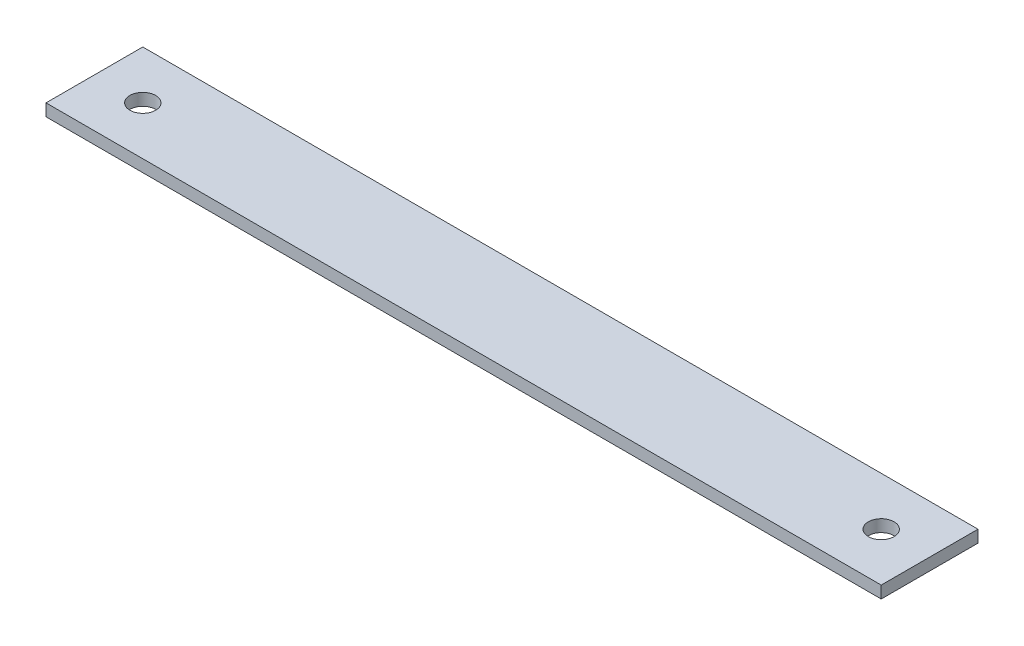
ISO-10303-21;
HEADER;
FILE_DESCRIPTION(('STEP AP214'),'2;1');
FILE_NAME('part.step','',(''),(''),'','','');
FILE_SCHEMA(('AUTOMOTIVE_DESIGN { 1 0 10303 214 1 1 1 1 }'));
ENDSEC;
DATA;
#1=APPLICATION_CONTEXT('core data for automotive mechanical design processes');
#2=APPLICATION_PROTOCOL_DEFINITION('international standard','automotive_design',2000,#1);
#3=PRODUCT_CONTEXT('',#1,'mechanical');
#4=PRODUCT('Part','Part','',(#3));
#5=PRODUCT_RELATED_PRODUCT_CATEGORY('part','',(#4));
#6=PRODUCT_DEFINITION_FORMATION('','',#4);
#7=PRODUCT_DEFINITION_CONTEXT('part definition',#1,'design');
#8=PRODUCT_DEFINITION('design','',#6,#7);
#9=PRODUCT_DEFINITION_SHAPE('','',#8);
#10=(LENGTH_UNIT() NAMED_UNIT(*) SI_UNIT(.MILLI.,.METRE.));
#11=(NAMED_UNIT(*) PLANE_ANGLE_UNIT() SI_UNIT($,.RADIAN.));
#12=(NAMED_UNIT(*) SI_UNIT($,.STERADIAN.) SOLID_ANGLE_UNIT());
#13=UNCERTAINTY_MEASURE_WITH_UNIT(LENGTH_MEASURE(1.E-05),#10,'distance_accuracy_value','');
#14=(GEOMETRIC_REPRESENTATION_CONTEXT(3) GLOBAL_UNCERTAINTY_ASSIGNED_CONTEXT((#13)) GLOBAL_UNIT_ASSIGNED_CONTEXT((#10,
#11,#12)) REPRESENTATION_CONTEXT('',''));
#15=CARTESIAN_POINT('',(0.,0.,0.));
#16=DIRECTION('',(0.,0.,1.));
#17=DIRECTION('',(1.,0.,0.));
#18=AXIS2_PLACEMENT_3D('',#15,#16,#17);
#19=CARTESIAN_POINT('',(109.601,3.175,-12.7));
#20=DIRECTION('',(-1.,0.,0.));
#21=DIRECTION('',(0.,0.,1.));
#22=AXIS2_PLACEMENT_3D('',#19,#20,#21);
#23=PLANE('',#22);
#24=DIRECTION('',(0.,0.,-1.));
#25=VECTOR('',#24,1.);
#26=CARTESIAN_POINT('',(109.601,0.,-12.7));
#27=LINE('',#26,#25);
#28=CARTESIAN_POINT('',(109.601,0.,12.7));
#29=VERTEX_POINT('',#28);
#30=CARTESIAN_POINT('',(109.601,0.,-12.7));
#31=VERTEX_POINT('',#30);
#32=EDGE_CURVE('E95',#29,#31,#27,.T.);
#33=ORIENTED_EDGE('',*,*,#32,.T.);
#34=DIRECTION('',(0.,-1.,0.));
#35=VECTOR('',#34,1.);
#36=CARTESIAN_POINT('',(109.601,3.175,-12.7));
#37=LINE('',#36,#35);
#38=CARTESIAN_POINT('',(109.601,3.175,-12.7));
#39=VERTEX_POINT('',#38);
#40=EDGE_CURVE('E11',#39,#31,#37,.T.);
#41=ORIENTED_EDGE('',*,*,#40,.F.);
#42=DIRECTION('',(0.,0.,-1.));
#43=VECTOR('',#42,1.);
#44=CARTESIAN_POINT('',(109.601,3.175,-12.7));
#45=LINE('',#44,#43);
#46=CARTESIAN_POINT('',(109.601,3.175,12.7));
#47=VERTEX_POINT('',#46);
#48=EDGE_CURVE('E83',#47,#39,#45,.T.);
#49=ORIENTED_EDGE('',*,*,#48,.F.);
#50=DIRECTION('',(0.,-1.,0.));
#51=VECTOR('',#50,1.);
#52=CARTESIAN_POINT('',(109.601,3.175,12.7));
#53=LINE('',#52,#51);
#54=EDGE_CURVE('E91',#47,#29,#53,.T.);
#55=ORIENTED_EDGE('',*,*,#54,.T.);
#56=EDGE_LOOP('',(#33,#41,#49,#55));
#57=FACE_BOUND('',#56,.T.);
#58=ADVANCED_FACE('F32',(#57),#23,.F.);
#59=CARTESIAN_POINT('',(-109.601,3.175,-12.7));
#60=DIRECTION('',(0.,0.,1.));
#61=DIRECTION('',(1.,0.,0.));
#62=AXIS2_PLACEMENT_3D('',#59,#60,#61);
#63=PLANE('',#62);
#64=DIRECTION('',(-1.,0.,0.));
#65=VECTOR('',#64,1.);
#66=CARTESIAN_POINT('',(-109.601,0.,-12.7));
#67=LINE('',#66,#65);
#68=CARTESIAN_POINT('',(-109.601,0.,-12.7));
#69=VERTEX_POINT('',#68);
#70=EDGE_CURVE('E87',#31,#69,#67,.T.);
#71=ORIENTED_EDGE('',*,*,#70,.T.);
#72=DIRECTION('',(0.,-1.,0.));
#73=VECTOR('',#72,1.);
#74=CARTESIAN_POINT('',(-109.601,3.175,-12.7));
#75=LINE('',#74,#73);
#76=CARTESIAN_POINT('',(-109.601,3.175,-12.7));
#77=VERTEX_POINT('',#76);
#78=EDGE_CURVE('E40',#77,#69,#75,.T.);
#79=ORIENTED_EDGE('',*,*,#78,.F.);
#80=DIRECTION('',(-1.,0.,0.));
#81=VECTOR('',#80,1.);
#82=CARTESIAN_POINT('',(-109.601,3.175,-12.7));
#83=LINE('',#82,#81);
#84=EDGE_CURVE('E78',#39,#77,#83,.T.);
#85=ORIENTED_EDGE('',*,*,#84,.F.);
#86=ORIENTED_EDGE('',*,*,#40,.T.);
#87=EDGE_LOOP('',(#71,#79,#85,#86));
#88=FACE_BOUND('',#87,.T.);
#89=ADVANCED_FACE('F86',(#88),#63,.F.);
#90=CARTESIAN_POINT('',(-109.601,3.175,-12.7));
#91=DIRECTION('',(1.,0.,0.));
#92=DIRECTION('',(0.,0.,-1.));
#93=AXIS2_PLACEMENT_3D('',#90,#91,#92);
#94=PLANE('',#93);
#95=DIRECTION('',(0.,0.,1.));
#96=VECTOR('',#95,1.);
#97=CARTESIAN_POINT('',(-109.601,0.,-12.7));
#98=LINE('',#97,#96);
#99=CARTESIAN_POINT('',(-109.601,0.,12.7));
#100=VERTEX_POINT('',#99);
#101=EDGE_CURVE('E65',#69,#100,#98,.T.);
#102=ORIENTED_EDGE('',*,*,#101,.T.);
#103=DIRECTION('',(0.,-1.,0.));
#104=VECTOR('',#103,1.);
#105=CARTESIAN_POINT('',(-109.601,3.175,12.7));
#106=LINE('',#105,#104);
#107=CARTESIAN_POINT('',(-109.601,3.175,12.7));
#108=VERTEX_POINT('',#107);
#109=EDGE_CURVE('E88',#108,#100,#106,.T.);
#110=ORIENTED_EDGE('',*,*,#109,.F.);
#111=DIRECTION('',(0.,0.,1.));
#112=VECTOR('',#111,1.);
#113=CARTESIAN_POINT('',(-109.601,3.175,-12.7));
#114=LINE('',#113,#112);
#115=EDGE_CURVE('E81',#77,#108,#114,.T.);
#116=ORIENTED_EDGE('',*,*,#115,.F.);
#117=ORIENTED_EDGE('',*,*,#78,.T.);
#118=EDGE_LOOP('',(#102,#110,#116,#117));
#119=FACE_BOUND('',#118,.T.);
#120=ADVANCED_FACE('F89',(#119),#94,.F.);
#121=CARTESIAN_POINT('',(-109.601,3.175,12.7));
#122=DIRECTION('',(0.,0.,-1.));
#123=DIRECTION('',(-1.,0.,0.));
#124=AXIS2_PLACEMENT_3D('',#121,#122,#123);
#125=PLANE('',#124);
#126=DIRECTION('',(1.,0.,0.));
#127=VECTOR('',#126,1.);
#128=CARTESIAN_POINT('',(-109.601,0.,12.7));
#129=LINE('',#128,#127);
#130=EDGE_CURVE('E71',#100,#29,#129,.T.);
#131=ORIENTED_EDGE('',*,*,#130,.T.);
#132=ORIENTED_EDGE('',*,*,#54,.F.);
#133=DIRECTION('',(1.,0.,0.));
#134=VECTOR('',#133,1.);
#135=CARTESIAN_POINT('',(-109.601,3.175,12.7));
#136=LINE('',#135,#134);
#137=EDGE_CURVE('E48',#108,#47,#136,.T.);
#138=ORIENTED_EDGE('',*,*,#137,.F.);
#139=ORIENTED_EDGE('',*,*,#109,.T.);
#140=EDGE_LOOP('',(#131,#132,#138,#139));
#141=FACE_BOUND('',#140,.T.);
#142=ADVANCED_FACE('F103',(#141),#125,.F.);
#143=CARTESIAN_POINT('',(109.601,3.175,12.7));
#144=DIRECTION('',(0.,1.,0.));
#145=DIRECTION('',(0.,0.,1.));
#146=AXIS2_PLACEMENT_3D('',#143,#144,#145);
#147=PLANE('',#146);
#148=CARTESIAN_POINT('',(96.901,3.175,0.));
#149=DIRECTION('',(0.,1.,0.));
#150=DIRECTION('',(0.,0.,1.));
#151=AXIS2_PLACEMENT_3D('',#148,#149,#150);
#152=CIRCLE('',#151,3.37819999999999);
#153=CARTESIAN_POINT('',(96.901,3.175,3.37819999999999));
#154=VERTEX_POINT('',#153);
#155=EDGE_CURVE('E115',#154,#154,#152,.T.);
#156=ORIENTED_EDGE('',*,*,#155,.F.);
#157=EDGE_LOOP('',(#156));
#158=FACE_BOUND('',#157,.T.);
#159=CARTESIAN_POINT('',(-96.901,3.175,0.));
#160=DIRECTION('',(0.,1.,0.));
#161=DIRECTION('',(0.,0.,1.));
#162=AXIS2_PLACEMENT_3D('',#159,#160,#161);
#163=CIRCLE('',#162,3.37819999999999);
#164=CARTESIAN_POINT('',(-96.901,3.175,3.37819999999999));
#165=VERTEX_POINT('',#164);
#166=EDGE_CURVE('E109',#165,#165,#163,.T.);
#167=ORIENTED_EDGE('',*,*,#166,.F.);
#168=EDGE_LOOP('',(#167));
#169=FACE_BOUND('',#168,.T.);
#170=ORIENTED_EDGE('',*,*,#48,.T.);
#171=ORIENTED_EDGE('',*,*,#84,.T.);
#172=ORIENTED_EDGE('',*,*,#115,.T.);
#173=ORIENTED_EDGE('',*,*,#137,.T.);
#174=EDGE_LOOP('',(#170,#171,#172,#173));
#175=FACE_BOUND('',#174,.T.);
#176=ADVANCED_FACE('F79',(#158,#169,#175),#147,.T.);
#177=CARTESIAN_POINT('',(109.601,0.,12.7));
#178=DIRECTION('',(0.,1.,0.));
#179=DIRECTION('',(0.,0.,1.));
#180=AXIS2_PLACEMENT_3D('',#177,#178,#179);
#181=PLANE('',#180);
#182=CARTESIAN_POINT('',(96.901,0.,0.));
#183=DIRECTION('',(0.,1.,0.));
#184=DIRECTION('',(0.,0.,1.));
#185=AXIS2_PLACEMENT_3D('',#182,#183,#184);
#186=CIRCLE('',#185,3.37819999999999);
#187=CARTESIAN_POINT('',(96.901,0.,3.37819999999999));
#188=VERTEX_POINT('',#187);
#189=EDGE_CURVE('E112',#188,#188,#186,.T.);
#190=ORIENTED_EDGE('',*,*,#189,.T.);
#191=EDGE_LOOP('',(#190));
#192=FACE_BOUND('',#191,.T.);
#193=CARTESIAN_POINT('',(-96.901,0.,0.));
#194=DIRECTION('',(0.,1.,0.));
#195=DIRECTION('',(0.,0.,1.));
#196=AXIS2_PLACEMENT_3D('',#193,#194,#195);
#197=CIRCLE('',#196,3.37819999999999);
#198=CARTESIAN_POINT('',(-96.901,0.,3.37819999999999));
#199=VERTEX_POINT('',#198);
#200=EDGE_CURVE('E98',#199,#199,#197,.T.);
#201=ORIENTED_EDGE('',*,*,#200,.T.);
#202=EDGE_LOOP('',(#201));
#203=FACE_BOUND('',#202,.T.);
#204=ORIENTED_EDGE('',*,*,#32,.F.);
#205=ORIENTED_EDGE('',*,*,#130,.F.);
#206=ORIENTED_EDGE('',*,*,#101,.F.);
#207=ORIENTED_EDGE('',*,*,#70,.F.);
#208=EDGE_LOOP('',(#204,#205,#206,#207));
#209=FACE_BOUND('',#208,.T.);
#210=ADVANCED_FACE('F106',(#192,#203,#209),#181,.F.);
#211=CARTESIAN_POINT('',(-96.901,0.,0.));
#212=DIRECTION('',(0.,1.,0.));
#213=DIRECTION('',(0.,0.,1.));
#214=AXIS2_PLACEMENT_3D('',#211,#212,#213);
#215=CYLINDRICAL_SURFACE('',#214,3.37819999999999);
#216=ORIENTED_EDGE('',*,*,#200,.F.);
#217=EDGE_LOOP('',(#216));
#218=FACE_BOUND('',#217,.T.);
#219=ORIENTED_EDGE('',*,*,#166,.T.);
#220=EDGE_LOOP('',(#219));
#221=FACE_BOUND('',#220,.T.);
#222=ADVANCED_FACE('F126',(#218,#221),#215,.F.);
#223=CARTESIAN_POINT('',(96.901,0.,0.));
#224=DIRECTION('',(0.,1.,0.));
#225=DIRECTION('',(0.,0.,1.));
#226=AXIS2_PLACEMENT_3D('',#223,#224,#225);
#227=CYLINDRICAL_SURFACE('',#226,3.37819999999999);
#228=ORIENTED_EDGE('',*,*,#189,.F.);
#229=EDGE_LOOP('',(#228));
#230=FACE_BOUND('',#229,.T.);
#231=ORIENTED_EDGE('',*,*,#155,.T.);
#232=EDGE_LOOP('',(#231));
#233=FACE_BOUND('',#232,.T.);
#234=ADVANCED_FACE('F123',(#230,#233),#227,.F.);
#235=CLOSED_SHELL('',(#58,#89,#120,#142,#176,#210,#222,#234));
#236=MANIFOLD_SOLID_BREP('B2',#235);
#237=ADVANCED_BREP_SHAPE_REPRESENTATION('',(#18,#236),#14);
#238=SHAPE_DEFINITION_REPRESENTATION(#9,#237);
ENDSEC;
END-ISO-10303-21;
